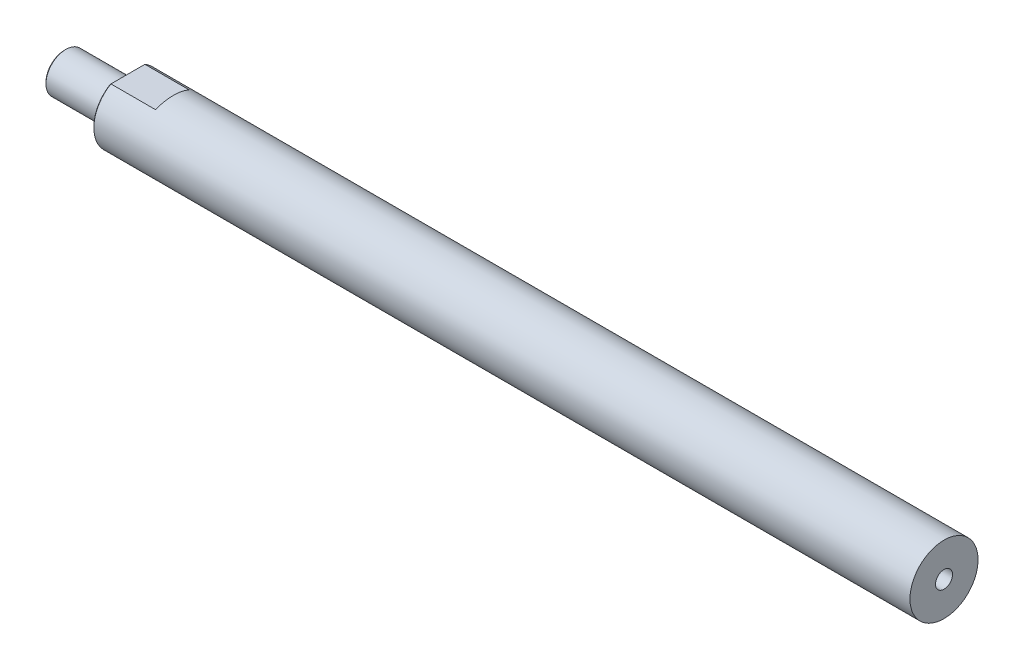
from build123d import *

# Parameters (mm, degrees)
F_1_2_20_TAPPED_HOLE1_D     = 11.50874
F_1_2_20_TAPPED_HOLE1_DEPTH = 22.352
F_1_2_20_TAPPED_HOLE1_TIP   = 3.45757432
FILLET1_R                   = 0.762
SKETCH5_R                   = 4.7625
CUT_EXTRUDE1_DEPTH          = 493.937953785
CUT_EXTRUDE2_DEPTH          = 458.993062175
CUT_EXTRUDE2_DEPTH_BACK     = 458.993062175
CHAMFER1_SIZE               = 0.762
CHAMFER2_SIZE               = 0.508


with BuildPart() as part:
    # Sketch1 → Revolve1 (revolve)
    with BuildSketch(Plane.XY, mode=Mode.PRIVATE) as revolve1_sk:
        Polygon((-35.0012, 11.1125), (0, 11.1125), (0, 19.05), (457.2, 19.05), (457.2, 0), (-35.0012, 0), align=None)
    revolve(revolve1_sk.sketch.rotate(Axis((-34.753378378, 0, 0), (1, 0, 0)), 90), axis=Axis((-34.753378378, 0, 0), (1, 0, 0)))

    # 1_2-20 Tapped Hole1
    with Locations(Plane.ZY.offset(35.0012)):
        with Locations((0, 0)):
            Hole(F_1_2_20_TAPPED_HOLE1_D / 2, depth=F_1_2_20_TAPPED_HOLE1_DEPTH)
            with Locations((0, 0, -(F_1_2_20_TAPPED_HOLE1_DEPTH + F_1_2_20_TAPPED_HOLE1_TIP / 2))):  # 118° drill point
                Cone(0, F_1_2_20_TAPPED_HOLE1_D / 2, F_1_2_20_TAPPED_HOLE1_TIP, mode=Mode.SUBTRACT)

    # Fillet1
    fillet1_edges = [part.edges().sort_by_distance(p)[0] for p in [
        (0, 0, -11.1125),
    ]]
    fillet(fillet1_edges, radius=FILLET1_R)

    # Sketch5 → Cut-Extrude1 (cut, through all)
    with BuildSketch(Plane(origin=(457.2, 0, 0), x_dir=(0, 0, -1), z_dir=(1, 0, 0))):
        Circle(SKETCH5_R)
    extrude(amount=-CUT_EXTRUDE1_DEPTH, mode=Mode.SUBTRACT)

    # Sketch6 → Cut-Extrude2 (cut, two sides: drawn at the far end of the back side and taken through both)
    with BuildSketch(Plane.XY.offset(-CUT_EXTRUDE2_DEPTH_BACK)):
        Polygon((-1.016, 16.51), (25.4, 16.51), (26.080590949, 19.05), (-1.016, 19.05), align=None)
    extrude(amount=CUT_EXTRUDE2_DEPTH + CUT_EXTRUDE2_DEPTH_BACK, mode=Mode.SUBTRACT)

    # Chamfer1
    chamfer1_edges = [part.edges().sort_by_distance(p)[0] for p in [
        (-35.0012, 0, -11.1125),
    ]]
    chamfer(chamfer1_edges, length=CHAMFER1_SIZE)

    # Chamfer2
    chamfer2_edges = [part.edges().sort_by_distance(p)[0] for p in [
        (0, -16.491665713, -9.535589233),
        (0, 16.51, 0),
    ]]
    chamfer(chamfer2_edges, length=CHAMFER2_SIZE)


solid = part.part
